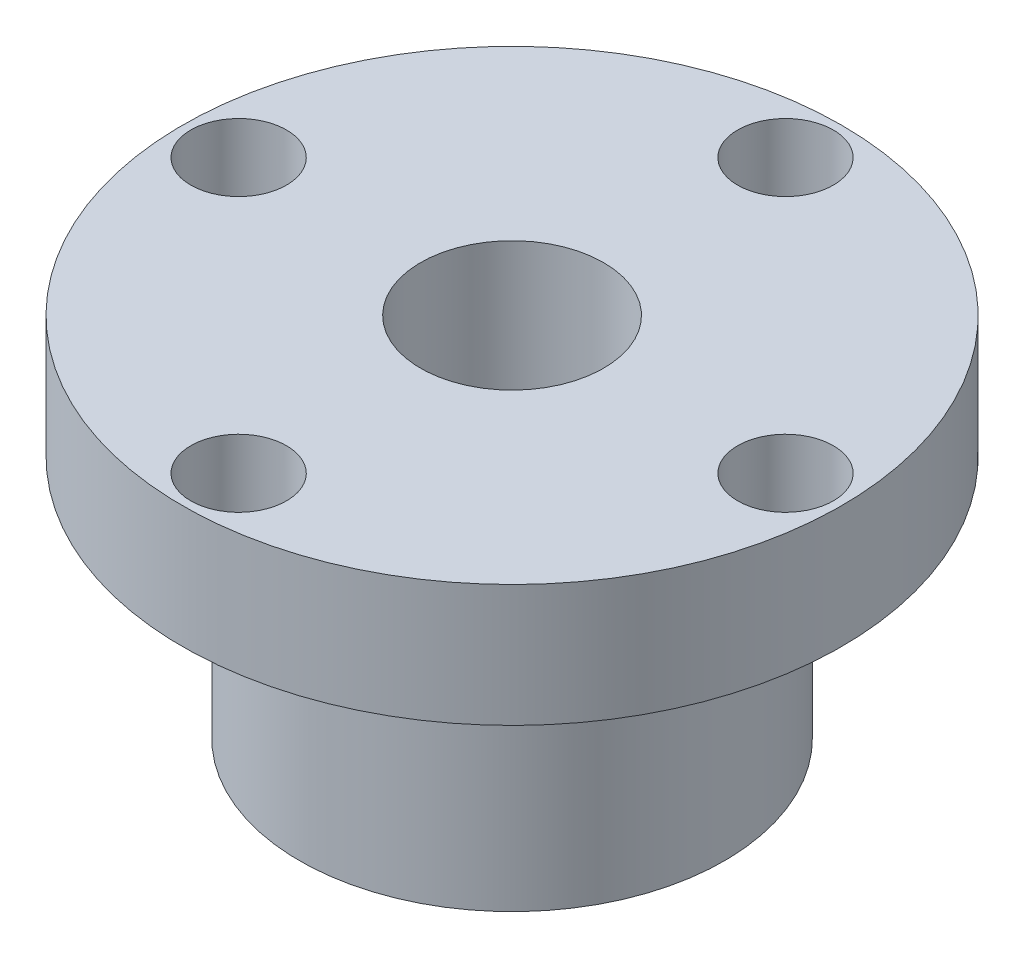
ISO-10303-21;
HEADER;
FILE_DESCRIPTION(('STEP AP214'),'2;1');
FILE_NAME('part.step','',(''),(''),'','','');
FILE_SCHEMA(('AUTOMOTIVE_DESIGN { 1 0 10303 214 1 1 1 1 }'));
ENDSEC;
DATA;
#1=APPLICATION_CONTEXT('core data for automotive mechanical design processes');
#2=APPLICATION_PROTOCOL_DEFINITION('international standard','automotive_design',2000,#1);
#3=PRODUCT_CONTEXT('',#1,'mechanical');
#4=PRODUCT('Part','Part','',(#3));
#5=PRODUCT_RELATED_PRODUCT_CATEGORY('part','',(#4));
#6=PRODUCT_DEFINITION_FORMATION('','',#4);
#7=PRODUCT_DEFINITION_CONTEXT('part definition',#1,'design');
#8=PRODUCT_DEFINITION('design','',#6,#7);
#9=PRODUCT_DEFINITION_SHAPE('','',#8);
#10=(LENGTH_UNIT() NAMED_UNIT(*) SI_UNIT(.MILLI.,.METRE.));
#11=(NAMED_UNIT(*) PLANE_ANGLE_UNIT() SI_UNIT($,.RADIAN.));
#12=(NAMED_UNIT(*) SI_UNIT($,.STERADIAN.) SOLID_ANGLE_UNIT());
#13=UNCERTAINTY_MEASURE_WITH_UNIT(LENGTH_MEASURE(1.E-05),#10,'distance_accuracy_value','');
#14=(GEOMETRIC_REPRESENTATION_CONTEXT(3) GLOBAL_UNCERTAINTY_ASSIGNED_CONTEXT((#13)) GLOBAL_UNIT_ASSIGNED_CONTEXT((#10,
#11,#12)) REPRESENTATION_CONTEXT('',''));
#15=CARTESIAN_POINT('',(0.,0.,0.));
#16=DIRECTION('',(0.,0.,1.));
#17=DIRECTION('',(1.,0.,0.));
#18=AXIS2_PLACEMENT_3D('',#15,#16,#17);
#19=CARTESIAN_POINT('',(0.,0.,0.));
#20=DIRECTION('',(0.,1.,0.));
#21=DIRECTION('',(0.,0.,1.));
#22=AXIS2_PLACEMENT_3D('',#19,#20,#21);
#23=PLANE('',#22);
#24=CARTESIAN_POINT('',(0.,0.,0.));
#25=DIRECTION('',(0.,1.,0.));
#26=DIRECTION('',(0.,0.,1.));
#27=AXIS2_PLACEMENT_3D('',#24,#25,#26);
#28=CIRCLE('',#27,4.7625);
#29=CARTESIAN_POINT('',(0.,0.,-4.7625));
#30=VERTEX_POINT('',#29);
#31=EDGE_CURVE('E47',#30,#30,#28,.T.);
#32=ORIENTED_EDGE('',*,*,#31,.T.);
#33=EDGE_LOOP('',(#32));
#34=FACE_BOUND('',#33,.T.);
#35=CARTESIAN_POINT('',(0.,0.,0.));
#36=DIRECTION('',(0.,-1.,0.));
#37=DIRECTION('',(0.,0.,-1.));
#38=AXIS2_PLACEMENT_3D('',#35,#36,#37);
#39=CIRCLE('',#38,11.049);
#40=CARTESIAN_POINT('',(0.,0.,-11.049));
#41=VERTEX_POINT('',#40);
#42=EDGE_CURVE('E58',#41,#41,#39,.T.);
#43=ORIENTED_EDGE('',*,*,#42,.T.);
#44=EDGE_LOOP('',(#43));
#45=FACE_BOUND('',#44,.T.);
#46=ADVANCED_FACE('F34',(#34,#45),#23,.F.);
#47=CARTESIAN_POINT('',(0.,19.05,0.));
#48=DIRECTION('',(0.,-1.,0.));
#49=DIRECTION('',(0.,0.,-1.));
#50=AXIS2_PLACEMENT_3D('',#47,#48,#49);
#51=CYLINDRICAL_SURFACE('',#50,17.145);
#52=CARTESIAN_POINT('',(0.,19.05,0.));
#53=DIRECTION('',(0.,1.,0.));
#54=DIRECTION('',(0.,0.,1.));
#55=AXIS2_PLACEMENT_3D('',#52,#53,#54);
#56=CIRCLE('',#55,17.145);
#57=CARTESIAN_POINT('',(0.,19.05,-17.145));
#58=VERTEX_POINT('',#57);
#59=EDGE_CURVE('E10',#58,#58,#56,.T.);
#60=CARTESIAN_POINT('',(0.,12.7,0.));
#61=DIRECTION('',(0.,-1.,0.));
#62=DIRECTION('',(0.,0.,-1.));
#63=AXIS2_PLACEMENT_3D('',#60,#61,#62);
#64=CIRCLE('',#63,17.145);
#65=CARTESIAN_POINT('',(0.,12.7,-17.145));
#66=VERTEX_POINT('',#65);
#67=EDGE_CURVE('E51',#66,#66,#64,.T.);
#68=CARTESIAN_POINT('',(0.,19.05,-17.145));
#69=CARTESIAN_POINT('',(0.,18.9838541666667,-17.145));
#70=CARTESIAN_POINT('',(0.,18.9177083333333,-17.145));
#71=CARTESIAN_POINT('',(0.,18.7854166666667,-17.145));
#72=CARTESIAN_POINT('',(0.,18.7192708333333,-17.145));
#73=CARTESIAN_POINT('',(0.,18.5869791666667,-17.145));
#74=CARTESIAN_POINT('',(0.,18.5208333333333,-17.145));
#75=CARTESIAN_POINT('',(0.,18.3885416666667,-17.145));
#76=CARTESIAN_POINT('',(0.,18.3223958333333,-17.145));
#77=CARTESIAN_POINT('',(0.,18.1901041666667,-17.145));
#78=CARTESIAN_POINT('',(0.,18.1239583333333,-17.145));
#79=CARTESIAN_POINT('',(0.,17.9916666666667,-17.145));
#80=CARTESIAN_POINT('',(0.,17.9255208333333,-17.145));
#81=CARTESIAN_POINT('',(0.,17.7932291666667,-17.145));
#82=CARTESIAN_POINT('',(0.,17.7270833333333,-17.145));
#83=CARTESIAN_POINT('',(0.,17.5947916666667,-17.145));
#84=CARTESIAN_POINT('',(0.,17.5286458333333,-17.145));
#85=CARTESIAN_POINT('',(0.,17.3963541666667,-17.145));
#86=CARTESIAN_POINT('',(0.,17.3302083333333,-17.145));
#87=CARTESIAN_POINT('',(0.,17.1979166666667,-17.145));
#88=CARTESIAN_POINT('',(0.,17.1317708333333,-17.145));
#89=CARTESIAN_POINT('',(0.,16.9994791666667,-17.145));
#90=CARTESIAN_POINT('',(0.,16.9333333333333,-17.145));
#91=CARTESIAN_POINT('',(0.,16.8010416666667,-17.145));
#92=CARTESIAN_POINT('',(0.,16.7348958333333,-17.145));
#93=CARTESIAN_POINT('',(0.,16.6026041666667,-17.145));
#94=CARTESIAN_POINT('',(0.,16.5364583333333,-17.145));
#95=CARTESIAN_POINT('',(0.,16.4041666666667,-17.145));
#96=CARTESIAN_POINT('',(0.,16.3380208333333,-17.145));
#97=CARTESIAN_POINT('',(0.,16.2057291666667,-17.145));
#98=CARTESIAN_POINT('',(0.,16.1395833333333,-17.145));
#99=CARTESIAN_POINT('',(0.,16.0072916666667,-17.145));
#100=CARTESIAN_POINT('',(0.,15.9411458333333,-17.145));
#101=CARTESIAN_POINT('',(0.,15.8088541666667,-17.145));
#102=CARTESIAN_POINT('',(0.,15.7427083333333,-17.145));
#103=CARTESIAN_POINT('',(0.,15.6104166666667,-17.145));
#104=CARTESIAN_POINT('',(0.,15.5442708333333,-17.145));
#105=CARTESIAN_POINT('',(0.,15.4119791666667,-17.145));
#106=CARTESIAN_POINT('',(0.,15.3458333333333,-17.145));
#107=CARTESIAN_POINT('',(0.,15.2135416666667,-17.145));
#108=CARTESIAN_POINT('',(0.,15.1473958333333,-17.145));
#109=CARTESIAN_POINT('',(0.,15.0151041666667,-17.145));
#110=CARTESIAN_POINT('',(0.,14.9489583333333,-17.145));
#111=CARTESIAN_POINT('',(0.,14.8166666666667,-17.145));
#112=CARTESIAN_POINT('',(0.,14.7505208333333,-17.145));
#113=CARTESIAN_POINT('',(0.,14.6182291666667,-17.145));
#114=CARTESIAN_POINT('',(0.,14.5520833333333,-17.145));
#115=CARTESIAN_POINT('',(0.,14.4197916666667,-17.145));
#116=CARTESIAN_POINT('',(0.,14.3536458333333,-17.145));
#117=CARTESIAN_POINT('',(0.,14.2213541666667,-17.145));
#118=CARTESIAN_POINT('',(0.,14.1552083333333,-17.145));
#119=CARTESIAN_POINT('',(0.,14.0229166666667,-17.145));
#120=CARTESIAN_POINT('',(0.,13.9567708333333,-17.145));
#121=CARTESIAN_POINT('',(0.,13.8244791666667,-17.145));
#122=CARTESIAN_POINT('',(0.,13.7583333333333,-17.145));
#123=CARTESIAN_POINT('',(0.,13.6260416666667,-17.145));
#124=CARTESIAN_POINT('',(0.,13.5598958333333,-17.145));
#125=CARTESIAN_POINT('',(0.,13.4276041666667,-17.145));
#126=CARTESIAN_POINT('',(0.,13.3614583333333,-17.145));
#127=CARTESIAN_POINT('',(0.,13.2291666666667,-17.145));
#128=CARTESIAN_POINT('',(0.,13.1630208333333,-17.145));
#129=CARTESIAN_POINT('',(0.,13.0307291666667,-17.145));
#130=CARTESIAN_POINT('',(0.,12.9645833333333,-17.145));
#131=CARTESIAN_POINT('',(0.,12.8322916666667,-17.145));
#132=CARTESIAN_POINT('',(0.,12.7661458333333,-17.145));
#133=CARTESIAN_POINT('',(0.,12.7,-17.145));
#134=B_SPLINE_CURVE_WITH_KNOTS('',3,(#68,#69,#70,#71,#72,#73,#74,#75,#76,#77,#78,#79,#80,#81,
#82,#83,#84,#85,#86,#87,#88,#89,#90,#91,#92,#93,#94,#95,#96,#97,#98,#99,#100,#101,#102,#103,
#104,#105,#106,#107,#108,#109,#110,#111,#112,#113,#114,#115,#116,#117,#118,#119,#120,#121,#122,
#123,#124,#125,#126,#127,#128,#129,#130,#131,#132,#133),.UNSPECIFIED.,.F.,.F.,(4,2,2,2,2,2,2,2,
2,2,2,2,2,2,2,2,2,2,2,2,2,2,2,2,2,2,2,2,2,2,2,2,4),(0.,0.198437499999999,0.396874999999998,
0.595312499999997,0.793749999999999,0.992187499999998,1.190625,1.3890625,1.5875,1.7859375,
1.984375,2.1828125,2.38125,2.5796875,2.778125,2.9765625,3.175,3.3734375,3.571875,3.7703125,
3.96875,4.1671875,4.365625,4.5640625,4.7625,4.9609375,5.159375,5.3578125,5.55625,5.7546875,
5.953125,6.1515625,6.35),.UNSPECIFIED.);
#135=EDGE_CURVE('BSEAM36',#58,#66,#134,.T.);
#136=ORIENTED_EDGE('',*,*,#59,.F.);
#137=ORIENTED_EDGE('',*,*,#67,.F.);
#138=ORIENTED_EDGE('',*,*,#135,.T.);
#139=ORIENTED_EDGE('',*,*,#135,.F.);
#140=EDGE_LOOP('',(#136,#138,#137,#139));
#141=FACE_BOUND('',#140,.T.);
#142=ADVANCED_FACE('F36',(#141),#51,.T.);
#143=CARTESIAN_POINT('',(0.,19.05,0.));
#144=DIRECTION('',(0.,1.,0.));
#145=DIRECTION('',(0.,0.,1.));
#146=AXIS2_PLACEMENT_3D('',#143,#144,#145);
#147=PLANE('',#146);
#148=CARTESIAN_POINT('',(1.4898857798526E-13,19.05,-14.224));
#149=DIRECTION('',(0.,1.,0.));
#150=DIRECTION('',(0.,0.,1.));
#151=AXIS2_PLACEMENT_3D('',#148,#149,#150);
#152=CIRCLE('',#151,2.4892);
#153=CARTESIAN_POINT('',(1.4898857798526E-13,19.05,-11.7348));
#154=VERTEX_POINT('',#153);
#155=EDGE_CURVE('E75',#154,#154,#152,.T.);
#156=ORIENTED_EDGE('',*,*,#155,.F.);
#157=EDGE_LOOP('',(#156));
#158=FACE_BOUND('',#157,.T.);
#159=CARTESIAN_POINT('',(-14.224,19.05,0.));
#160=DIRECTION('',(0.,1.,0.));
#161=DIRECTION('',(0.,0.,1.));
#162=AXIS2_PLACEMENT_3D('',#159,#160,#161);
#163=CIRCLE('',#162,2.4892);
#164=CARTESIAN_POINT('',(-14.224,19.05,2.4891999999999));
#165=VERTEX_POINT('',#164);
#166=EDGE_CURVE('E65',#165,#165,#163,.T.);
#167=ORIENTED_EDGE('',*,*,#166,.F.);
#168=EDGE_LOOP('',(#167));
#169=FACE_BOUND('',#168,.T.);
#170=CARTESIAN_POINT('',(0.,19.05,14.224));
#171=DIRECTION('',(0.,1.,0.));
#172=DIRECTION('',(0.,0.,1.));
#173=AXIS2_PLACEMENT_3D('',#170,#171,#172);
#174=CIRCLE('',#173,2.4892);
#175=CARTESIAN_POINT('',(0.,19.05,16.7132));
#176=VERTEX_POINT('',#175);
#177=EDGE_CURVE('E62',#176,#176,#174,.T.);
#178=ORIENTED_EDGE('',*,*,#177,.F.);
#179=EDGE_LOOP('',(#178));
#180=FACE_BOUND('',#179,.T.);
#181=CARTESIAN_POINT('',(14.224,19.05,0.));
#182=DIRECTION('',(0.,1.,0.));
#183=DIRECTION('',(0.,0.,1.));
#184=AXIS2_PLACEMENT_3D('',#181,#182,#183);
#185=CIRCLE('',#184,2.4892);
#186=CARTESIAN_POINT('',(14.224,19.05,2.4892));
#187=VERTEX_POINT('',#186);
#188=EDGE_CURVE('E59',#187,#187,#185,.T.);
#189=ORIENTED_EDGE('',*,*,#188,.F.);
#190=EDGE_LOOP('',(#189));
#191=FACE_BOUND('',#190,.T.);
#192=ORIENTED_EDGE('',*,*,#59,.T.);
#193=EDGE_LOOP('',(#192));
#194=FACE_BOUND('',#193,.T.);
#195=CARTESIAN_POINT('',(0.,19.05,0.));
#196=DIRECTION('',(0.,1.,0.));
#197=DIRECTION('',(0.,0.,1.));
#198=AXIS2_PLACEMENT_3D('',#195,#196,#197);
#199=CIRCLE('',#198,4.7625);
#200=CARTESIAN_POINT('',(0.,19.05,-4.7625));
#201=VERTEX_POINT('',#200);
#202=EDGE_CURVE('E42',#201,#201,#199,.T.);
#203=ORIENTED_EDGE('',*,*,#202,.F.);
#204=EDGE_LOOP('',(#203));
#205=FACE_BOUND('',#204,.T.);
#206=ADVANCED_FACE('F91',(#158,#169,#180,#191,#194,#205),#147,.T.);
#207=CARTESIAN_POINT('',(0.,19.05,0.));
#208=DIRECTION('',(0.,-1.,0.));
#209=DIRECTION('',(0.,0.,-1.));
#210=AXIS2_PLACEMENT_3D('',#207,#208,#209);
#211=CYLINDRICAL_SURFACE('',#210,4.7625);
#212=CARTESIAN_POINT('',(0.,19.05,-4.7625));
#213=CARTESIAN_POINT('',(0.,18.8515625,-4.7625));
#214=CARTESIAN_POINT('',(0.,18.653125,-4.7625));
#215=CARTESIAN_POINT('',(0.,18.25625,-4.7625));
#216=CARTESIAN_POINT('',(0.,18.0578125,-4.7625));
#217=CARTESIAN_POINT('',(0.,17.6609375,-4.7625));
#218=CARTESIAN_POINT('',(0.,17.4625,-4.7625));
#219=CARTESIAN_POINT('',(0.,17.065625,-4.7625));
#220=CARTESIAN_POINT('',(0.,16.8671875,-4.7625));
#221=CARTESIAN_POINT('',(0.,16.4703125,-4.7625));
#222=CARTESIAN_POINT('',(0.,16.271875,-4.7625));
#223=CARTESIAN_POINT('',(0.,15.875,-4.7625));
#224=CARTESIAN_POINT('',(0.,15.6765625,-4.7625));
#225=CARTESIAN_POINT('',(0.,15.2796875,-4.7625));
#226=CARTESIAN_POINT('',(0.,15.08125,-4.7625));
#227=CARTESIAN_POINT('',(0.,14.684375,-4.7625));
#228=CARTESIAN_POINT('',(0.,14.4859375,-4.7625));
#229=CARTESIAN_POINT('',(0.,14.0890625,-4.7625));
#230=CARTESIAN_POINT('',(0.,13.890625,-4.7625));
#231=CARTESIAN_POINT('',(0.,13.49375,-4.7625));
#232=CARTESIAN_POINT('',(0.,13.2953125,-4.7625));
#233=CARTESIAN_POINT('',(0.,12.8984375,-4.7625));
#234=CARTESIAN_POINT('',(0.,12.7,-4.7625));
#235=CARTESIAN_POINT('',(0.,12.303125,-4.7625));
#236=CARTESIAN_POINT('',(0.,12.1046875,-4.7625));
#237=CARTESIAN_POINT('',(0.,11.7078125,-4.7625));
#238=CARTESIAN_POINT('',(0.,11.509375,-4.7625));
#239=CARTESIAN_POINT('',(0.,11.1125,-4.7625));
#240=CARTESIAN_POINT('',(0.,10.9140625,-4.7625));
#241=CARTESIAN_POINT('',(0.,10.5171875,-4.7625));
#242=CARTESIAN_POINT('',(0.,10.31875,-4.7625));
#243=CARTESIAN_POINT('',(0.,9.921875,-4.7625));
#244=CARTESIAN_POINT('',(0.,9.7234375,-4.7625));
#245=CARTESIAN_POINT('',(0.,9.3265625,-4.7625));
#246=CARTESIAN_POINT('',(0.,9.128125,-4.7625));
#247=CARTESIAN_POINT('',(0.,8.73125,-4.7625));
#248=CARTESIAN_POINT('',(0.,8.5328125,-4.7625));
#249=CARTESIAN_POINT('',(0.,8.1359375,-4.7625));
#250=CARTESIAN_POINT('',(0.,7.9375,-4.7625));
#251=CARTESIAN_POINT('',(0.,7.540625,-4.7625));
#252=CARTESIAN_POINT('',(0.,7.3421875,-4.7625));
#253=CARTESIAN_POINT('',(0.,6.9453125,-4.7625));
#254=CARTESIAN_POINT('',(0.,6.746875,-4.7625));
#255=CARTESIAN_POINT('',(0.,6.35,-4.7625));
#256=CARTESIAN_POINT('',(0.,6.1515625,-4.7625));
#257=CARTESIAN_POINT('',(0.,5.7546875,-4.7625));
#258=CARTESIAN_POINT('',(0.,5.55625,-4.7625));
#259=CARTESIAN_POINT('',(0.,5.159375,-4.7625));
#260=CARTESIAN_POINT('',(0.,4.9609375,-4.7625));
#261=CARTESIAN_POINT('',(0.,4.5640625,-4.7625));
#262=CARTESIAN_POINT('',(0.,4.365625,-4.7625));
#263=CARTESIAN_POINT('',(0.,3.96875,-4.7625));
#264=CARTESIAN_POINT('',(0.,3.7703125,-4.7625));
#265=CARTESIAN_POINT('',(0.,3.3734375,-4.7625));
#266=CARTESIAN_POINT('',(0.,3.175,-4.7625));
#267=CARTESIAN_POINT('',(0.,2.778125,-4.7625));
#268=CARTESIAN_POINT('',(0.,2.5796875,-4.7625));
#269=CARTESIAN_POINT('',(0.,2.1828125,-4.7625));
#270=CARTESIAN_POINT('',(0.,1.984375,-4.7625));
#271=CARTESIAN_POINT('',(0.,1.5875,-4.7625));
#272=CARTESIAN_POINT('',(0.,1.3890625,-4.7625));
#273=CARTESIAN_POINT('',(0.,0.992187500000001,-4.7625));
#274=CARTESIAN_POINT('',(0.,0.793750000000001,-4.7625));
#275=CARTESIAN_POINT('',(0.,0.396875,-4.7625));
#276=CARTESIAN_POINT('',(0.,0.1984375,-4.7625));
#277=CARTESIAN_POINT('',(0.,0.,-4.7625));
#278=B_SPLINE_CURVE_WITH_KNOTS('',3,(#212,#213,#214,#215,#216,#217,#218,#219,#220,#221,#222,
#223,#224,#225,#226,#227,#228,#229,#230,#231,#232,#233,#234,#235,#236,#237,#238,#239,#240,#241,
#242,#243,#244,#245,#246,#247,#248,#249,#250,#251,#252,#253,#254,#255,#256,#257,#258,#259,#260,
#261,#262,#263,#264,#265,#266,#267,#268,#269,#270,#271,#272,#273,#274,#275,#276,#277),
.UNSPECIFIED.,.F.,.F.,(4,2,2,2,2,2,2,2,2,2,2,2,2,2,2,2,2,2,2,2,2,2,2,2,2,2,2,2,2,2,2,2,4),(0.,
0.5953125,1.190625,1.7859375,2.38125,2.9765625,3.571875,4.1671875,4.7625,5.3578125,5.953125,
6.5484375,7.14375,7.7390625,8.334375,8.9296875,9.525,10.1203125,10.715625,11.3109375,11.90625,
12.5015625,13.096875,13.6921875,14.2875,14.8828125,15.478125,16.0734375,16.66875,17.2640625,
17.859375,18.4546875,19.05),.UNSPECIFIED.);
#279=EDGE_CURVE('BSEAM88',#201,#30,#278,.T.);
#280=ORIENTED_EDGE('',*,*,#202,.T.);
#281=ORIENTED_EDGE('',*,*,#31,.F.);
#282=ORIENTED_EDGE('',*,*,#279,.T.);
#283=ORIENTED_EDGE('',*,*,#279,.F.);
#284=EDGE_LOOP('',(#280,#282,#281,#283));
#285=FACE_BOUND('',#284,.T.);
#286=ADVANCED_FACE('F88',(#285),#211,.F.);
#287=CARTESIAN_POINT('',(0.,12.7,0.));
#288=DIRECTION('',(0.,-1.,0.));
#289=DIRECTION('',(0.,0.,-1.));
#290=AXIS2_PLACEMENT_3D('',#287,#288,#289);
#291=PLANE('',#290);
#292=CARTESIAN_POINT('',(1.4898857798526E-13,12.7,-14.224));
#293=DIRECTION('',(0.,-1.,0.));
#294=DIRECTION('',(0.,0.,-1.));
#295=AXIS2_PLACEMENT_3D('',#292,#293,#294);
#296=CIRCLE('',#295,2.4892);
#297=CARTESIAN_POINT('',(1.4898857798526E-13,12.7,-16.7132));
#298=VERTEX_POINT('',#297);
#299=EDGE_CURVE('E38',#298,#298,#296,.T.);
#300=ORIENTED_EDGE('',*,*,#299,.F.);
#301=EDGE_LOOP('',(#300));
#302=FACE_BOUND('',#301,.T.);
#303=CARTESIAN_POINT('',(-14.224,12.7,0.));
#304=DIRECTION('',(0.,-1.,0.));
#305=DIRECTION('',(0.,0.,-1.));
#306=AXIS2_PLACEMENT_3D('',#303,#304,#305);
#307=CIRCLE('',#306,2.4892);
#308=CARTESIAN_POINT('',(-14.224,12.7,-2.4892000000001));
#309=VERTEX_POINT('',#308);
#310=EDGE_CURVE('E63',#309,#309,#307,.T.);
#311=ORIENTED_EDGE('',*,*,#310,.F.);
#312=EDGE_LOOP('',(#311));
#313=FACE_BOUND('',#312,.T.);
#314=CARTESIAN_POINT('',(0.,12.7,14.224));
#315=DIRECTION('',(0.,-1.,0.));
#316=DIRECTION('',(0.,0.,-1.));
#317=AXIS2_PLACEMENT_3D('',#314,#315,#316);
#318=CIRCLE('',#317,2.4892);
#319=CARTESIAN_POINT('',(0.,12.7,11.7348));
#320=VERTEX_POINT('',#319);
#321=EDGE_CURVE('E60',#320,#320,#318,.T.);
#322=ORIENTED_EDGE('',*,*,#321,.F.);
#323=EDGE_LOOP('',(#322));
#324=FACE_BOUND('',#323,.T.);
#325=CARTESIAN_POINT('',(14.224,12.7,0.));
#326=DIRECTION('',(0.,-1.,0.));
#327=DIRECTION('',(0.,0.,-1.));
#328=AXIS2_PLACEMENT_3D('',#325,#326,#327);
#329=CIRCLE('',#328,2.4892);
#330=CARTESIAN_POINT('',(14.224,12.7,-2.4892));
#331=VERTEX_POINT('',#330);
#332=EDGE_CURVE('E55',#331,#331,#329,.T.);
#333=ORIENTED_EDGE('',*,*,#332,.F.);
#334=EDGE_LOOP('',(#333));
#335=FACE_BOUND('',#334,.T.);
#336=CARTESIAN_POINT('',(0.,12.7,0.));
#337=DIRECTION('',(0.,-1.,0.));
#338=DIRECTION('',(0.,0.,-1.));
#339=AXIS2_PLACEMENT_3D('',#336,#337,#338);
#340=CIRCLE('',#339,11.049);
#341=CARTESIAN_POINT('',(0.,12.7,-11.049));
#342=VERTEX_POINT('',#341);
#343=EDGE_CURVE('E54',#342,#342,#340,.T.);
#344=ORIENTED_EDGE('',*,*,#343,.F.);
#345=EDGE_LOOP('',(#344));
#346=FACE_BOUND('',#345,.T.);
#347=ORIENTED_EDGE('',*,*,#67,.T.);
#348=EDGE_LOOP('',(#347));
#349=FACE_BOUND('',#348,.T.);
#350=ADVANCED_FACE('F90',(#302,#313,#324,#335,#346,#349),#291,.T.);
#351=CARTESIAN_POINT('',(0.,12.7,0.));
#352=DIRECTION('',(0.,-1.,0.));
#353=DIRECTION('',(0.,0.,-1.));
#354=AXIS2_PLACEMENT_3D('',#351,#352,#353);
#355=CYLINDRICAL_SURFACE('',#354,11.049);
#356=ORIENTED_EDGE('',*,*,#343,.T.);
#357=EDGE_LOOP('',(#356));
#358=FACE_BOUND('',#357,.T.);
#359=ORIENTED_EDGE('',*,*,#42,.F.);
#360=EDGE_LOOP('',(#359));
#361=FACE_BOUND('',#360,.T.);
#362=ADVANCED_FACE('F98',(#358,#361),#355,.T.);
#363=CARTESIAN_POINT('',(14.224,19.05,0.));
#364=DIRECTION('',(0.,1.,0.));
#365=DIRECTION('',(0.,0.,1.));
#366=AXIS2_PLACEMENT_3D('',#363,#364,#365);
#367=CYLINDRICAL_SURFACE('',#366,2.4892);
#368=ORIENTED_EDGE('',*,*,#332,.T.);
#369=EDGE_LOOP('',(#368));
#370=FACE_BOUND('',#369,.T.);
#371=ORIENTED_EDGE('',*,*,#188,.T.);
#372=EDGE_LOOP('',(#371));
#373=FACE_BOUND('',#372,.T.);
#374=ADVANCED_FACE('F125',(#370,#373),#367,.F.);
#375=CARTESIAN_POINT('',(0.,19.05,14.224));
#376=DIRECTION('',(0.,1.,0.));
#377=DIRECTION('',(0.,0.,1.));
#378=AXIS2_PLACEMENT_3D('',#375,#376,#377);
#379=CYLINDRICAL_SURFACE('',#378,2.4892);
#380=ORIENTED_EDGE('',*,*,#321,.T.);
#381=EDGE_LOOP('',(#380));
#382=FACE_BOUND('',#381,.T.);
#383=ORIENTED_EDGE('',*,*,#177,.T.);
#384=EDGE_LOOP('',(#383));
#385=FACE_BOUND('',#384,.T.);
#386=ADVANCED_FACE('F138',(#382,#385),#379,.F.);
#387=CARTESIAN_POINT('',(-14.224,19.05,0.));
#388=DIRECTION('',(0.,1.,0.));
#389=DIRECTION('',(0.,0.,1.));
#390=AXIS2_PLACEMENT_3D('',#387,#388,#389);
#391=CYLINDRICAL_SURFACE('',#390,2.4892);
#392=ORIENTED_EDGE('',*,*,#310,.T.);
#393=EDGE_LOOP('',(#392));
#394=FACE_BOUND('',#393,.T.);
#395=ORIENTED_EDGE('',*,*,#166,.T.);
#396=EDGE_LOOP('',(#395));
#397=FACE_BOUND('',#396,.T.);
#398=ADVANCED_FACE('F143',(#394,#397),#391,.F.);
#399=CARTESIAN_POINT('',(1.4898857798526E-13,19.05,-14.224));
#400=DIRECTION('',(0.,1.,0.));
#401=DIRECTION('',(0.,0.,1.));
#402=AXIS2_PLACEMENT_3D('',#399,#400,#401);
#403=CYLINDRICAL_SURFACE('',#402,2.4892);
#404=ORIENTED_EDGE('',*,*,#299,.T.);
#405=EDGE_LOOP('',(#404));
#406=FACE_BOUND('',#405,.T.);
#407=ORIENTED_EDGE('',*,*,#155,.T.);
#408=EDGE_LOOP('',(#407));
#409=FACE_BOUND('',#408,.T.);
#410=ADVANCED_FACE('F153',(#406,#409),#403,.F.);
#411=CLOSED_SHELL('',(#46,#142,#206,#286,#350,#362,#374,#386,#398,#410));
#412=MANIFOLD_SOLID_BREP('B2',#411);
#413=ADVANCED_BREP_SHAPE_REPRESENTATION('',(#18,#412),#14);
#414=SHAPE_DEFINITION_REPRESENTATION(#9,#413);
ENDSEC;
END-ISO-10303-21;
